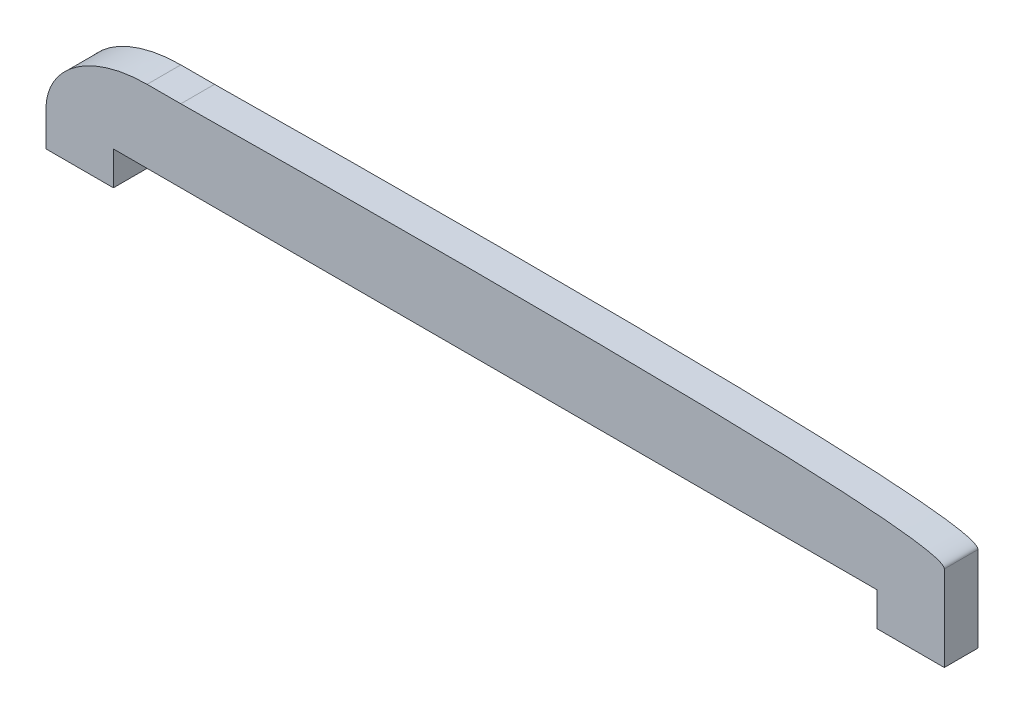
from build123d import *

# Parameters (mm, degrees)
BOSS_EXTRUDE1_DEPTH = 3.175


with BuildPart() as part:
    # Sketch1 → Boss-Extrude1 (new body)
    with BuildSketch(Plane.XY):
        with BuildLine():
            Line((-3.175, 0), (-9.525, 0))
            Line((-9.525, 0), (-9.525, 3.175))
            add(Edge.make_bspline(
                [(-9.525, 3.175), (-9.568115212, 6.955140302), (-5.360681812, 10.026580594), (0, 10.033)],
                knots=[0, 0, 0, 0, 1, 1, 1, 1], degree=3))
            Line((0, 10.033), (3.175, 10.033))
            add(Edge.make_bspline(
                [(3.175, 10.033), (30.368506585, 10.35565546), (74.951123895, 10.458363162), (75.102500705, 8.046424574)],
                knots=[0, 0, 0, 0, 1, 1, 1, 1], degree=3))
            Line((75.102500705, 8.046424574), (75.102500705, 0))
            Line((75.102500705, 0), (68.752500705, 0))
            Line((68.752500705, 0), (68.752500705, 3.175))
            Line((68.752500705, 3.175), (-3.175, 3.175))
            Line((-3.175, 3.175), (-3.175, 0))
        make_face()
    extrude(amount=-BOSS_EXTRUDE1_DEPTH)


solid = part.part
